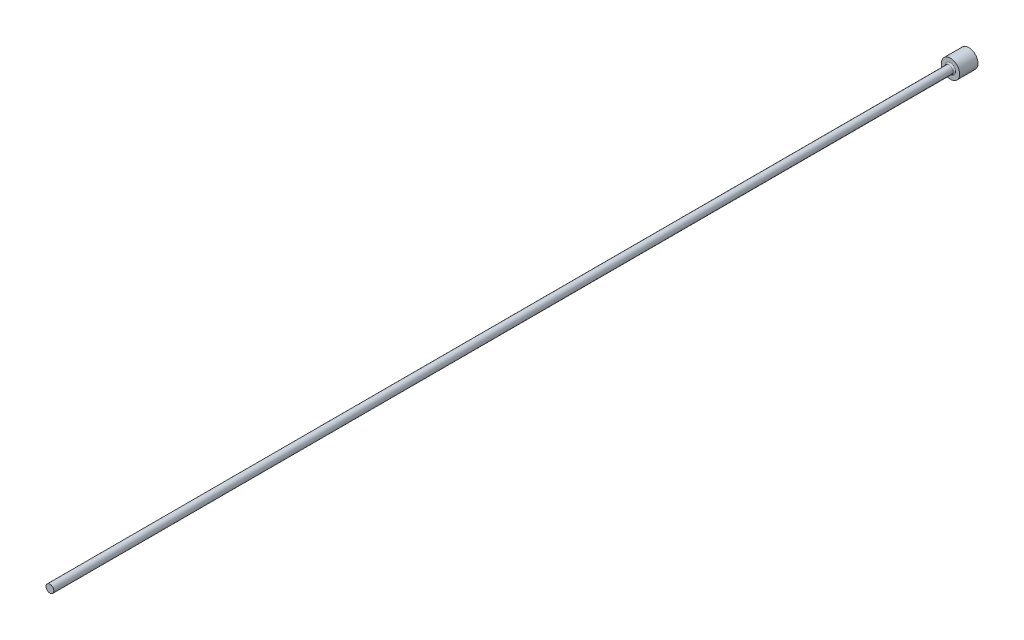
from build123d import *

# Parameters (mm, degrees)
FILLET1_R = 0.3


with BuildPart() as part:
    # FV → Revolve1 (revolve)
    with BuildSketch(Plane(origin=(0, 0, 0), x_dir=(1, 0, 0), z_dir=(0, 1, 0)), mode=Mode.PRIVATE) as revolve1_sk:
        Polygon((0, 0), (2, 0), (2, -4), (0.85, -4), (0.85, -200), (0, -200), align=None)
    revolve(revolve1_sk.sketch.rotate(Axis((0, 0, -9.033228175), (0, 0, 1)), 180), axis=Axis((0, 0, -9.033228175), (0, 0, 1)))

    # Fillet1
    fillet1_edges = [part.edges().sort_by_distance(p)[0] for p in [
        (0.85, 0, 4),
    ]]
    fillet(fillet1_edges, radius=FILLET1_R)


solid = part.part
